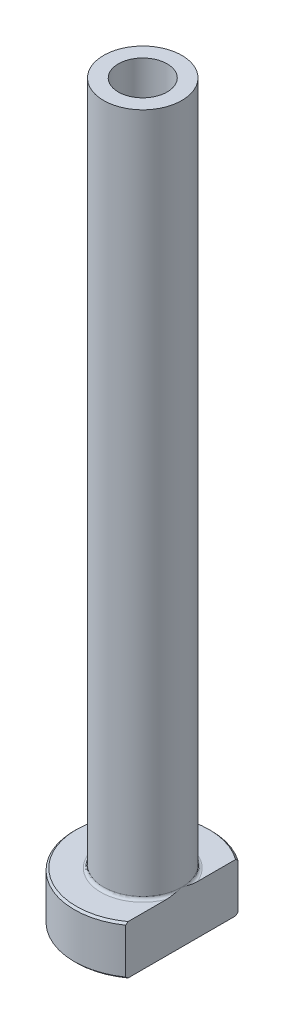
from build123d import *

# Parameters (mm, degrees)
FILLET1_R          = 0.3
CHAMFER1_SIZE      = 0.2
CUT_EXTRUDE1_DEPTH = 76.650512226
CHAMFER2_SIZE      = 0.5


with BuildPart() as part:
    # Sketch1 → Revolve1 (revolve)
    with BuildSketch(Plane.XY, mode=Mode.PRIVATE) as revolve1_sk:
        Polygon((-2.5, 75), (-4, 75), (-4, 5), (-7, 5), (-7, 0), (-2.75, 0), (-2.75, 18), (-2.5, 30), align=None)
    revolve(revolve1_sk.sketch.rotate(Axis((0, 92.187680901, 0), (0, -1, 0)), 270), axis=Axis((0, 92.187680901, 0), (0, -1, 0)))

    # Fillet1
    fillet1_edges = [part.edges().sort_by_distance(p)[0] for p in [
        (0, 5, -4),
    ]]
    fillet(fillet1_edges, radius=FILLET1_R)

    # Chamfer1
    chamfer1_edges = [part.edges().sort_by_distance(p)[0] for p in [
        (0, 0, -7),
        (0, 5, -7),
    ]]
    chamfer(chamfer1_edges, length=CHAMFER1_SIZE)

    # Sketch2 → Cut-Extrude1 (cut, through all)
    with BuildSketch(Plane.XZ):
        with BuildLine():
            Line((4, 5.744562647), (4, -5.744562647))
            ThreePointArc((4, -5.744562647), (7, 0), (4, 5.744562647))
        make_face()
    extrude(amount=-CUT_EXTRUDE1_DEPTH, mode=Mode.SUBTRACT)

    # Chamfer2
    chamfer2_edges = [part.edges().sort_by_distance(p)[0] for p in [
        (0, 0, -2.75),
    ]]
    chamfer(chamfer2_edges, length=CHAMFER2_SIZE)


solid = part.part
